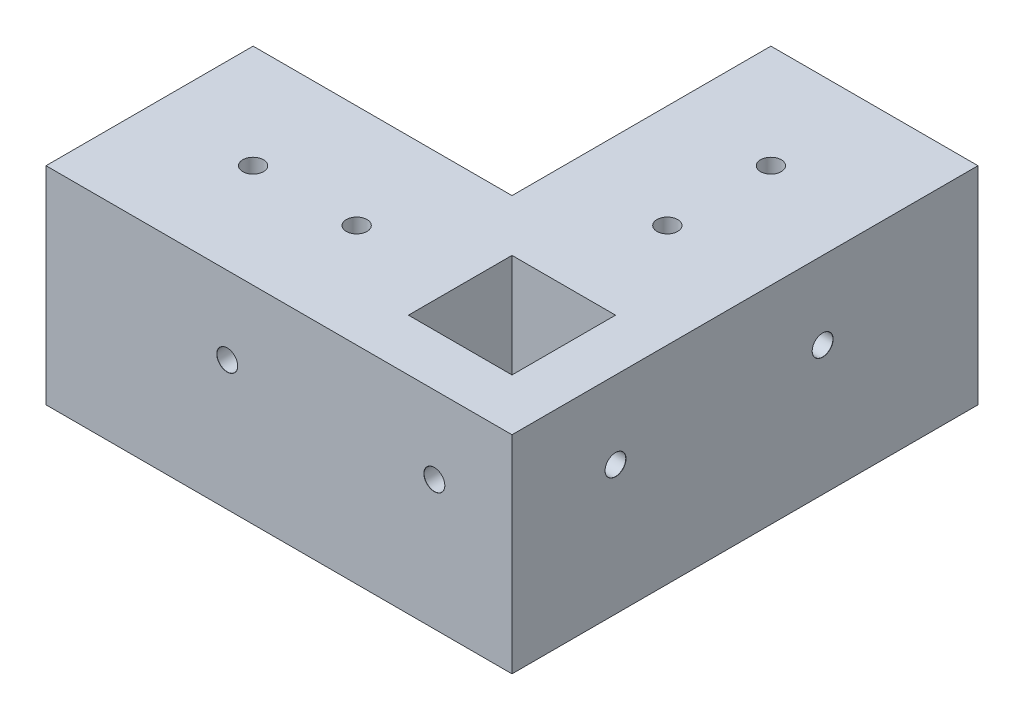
ISO-10303-21;
HEADER;
FILE_DESCRIPTION(('STEP AP214'),'2;1');
FILE_NAME('part.step','',(''),(''),'','','');
FILE_SCHEMA(('AUTOMOTIVE_DESIGN { 1 0 10303 214 1 1 1 1 }'));
ENDSEC;
DATA;
#1=APPLICATION_CONTEXT('core data for automotive mechanical design processes');
#2=APPLICATION_PROTOCOL_DEFINITION('international standard','automotive_design',2000,#1);
#3=PRODUCT_CONTEXT('',#1,'mechanical');
#4=PRODUCT('Part','Part','',(#3));
#5=PRODUCT_RELATED_PRODUCT_CATEGORY('part','',(#4));
#6=PRODUCT_DEFINITION_FORMATION('','',#4);
#7=PRODUCT_DEFINITION_CONTEXT('part definition',#1,'design');
#8=PRODUCT_DEFINITION('design','',#6,#7);
#9=PRODUCT_DEFINITION_SHAPE('','',#8);
#10=(LENGTH_UNIT() NAMED_UNIT(*) SI_UNIT(.MILLI.,.METRE.));
#11=(NAMED_UNIT(*) PLANE_ANGLE_UNIT() SI_UNIT($,.RADIAN.));
#12=(NAMED_UNIT(*) SI_UNIT($,.STERADIAN.) SOLID_ANGLE_UNIT());
#13=UNCERTAINTY_MEASURE_WITH_UNIT(LENGTH_MEASURE(1.E-05),#10,'distance_accuracy_value','');
#14=(GEOMETRIC_REPRESENTATION_CONTEXT(3) GLOBAL_UNCERTAINTY_ASSIGNED_CONTEXT((#13)) GLOBAL_UNIT_ASSIGNED_CONTEXT((#10,
#11,#12)) REPRESENTATION_CONTEXT('',''));
#15=CARTESIAN_POINT('',(0.,0.,0.));
#16=DIRECTION('',(0.,0.,1.));
#17=DIRECTION('',(1.,0.,0.));
#18=AXIS2_PLACEMENT_3D('',#15,#16,#17);
#19=CARTESIAN_POINT('',(0.,40.,-50.));
#20=DIRECTION('',(1.,0.,0.));
#21=DIRECTION('',(0.,0.,-1.));
#22=AXIS2_PLACEMENT_3D('',#19,#20,#21);
#23=PLANE('',#22);
#24=DIRECTION('',(0.,-1.,0.));
#25=VECTOR('',#24,1.);
#26=CARTESIAN_POINT('',(0.,40.,-50.));
#27=LINE('',#26,#25);
#28=CARTESIAN_POINT('',(0.,40.,-50.));
#29=VERTEX_POINT('',#28);
#30=CARTESIAN_POINT('',(0.,5.,-50.));
#31=VERTEX_POINT('',#30);
#32=EDGE_CURVE('E228',#29,#31,#27,.T.);
#33=ORIENTED_EDGE('',*,*,#32,.T.);
#34=DIRECTION('',(0.,0.,1.));
#35=VECTOR('',#34,1.);
#36=CARTESIAN_POINT('',(0.,5.,0.));
#37=LINE('',#36,#35);
#38=CARTESIAN_POINT('',(0.,5.,0.));
#39=VERTEX_POINT('',#38);
#40=EDGE_CURVE('E46',#31,#39,#37,.T.);
#41=ORIENTED_EDGE('',*,*,#40,.T.);
#42=DIRECTION('',(0.,-1.,0.));
#43=VECTOR('',#42,1.);
#44=CARTESIAN_POINT('',(0.,40.,0.));
#45=LINE('',#44,#43);
#46=CARTESIAN_POINT('',(0.,40.,0.));
#47=VERTEX_POINT('',#46);
#48=EDGE_CURVE('E248',#47,#39,#45,.T.);
#49=ORIENTED_EDGE('',*,*,#48,.F.);
#50=DIRECTION('',(0.,0.,1.));
#51=VECTOR('',#50,1.);
#52=CARTESIAN_POINT('',(0.,40.,-50.));
#53=LINE('',#52,#51);
#54=EDGE_CURVE('E214',#29,#47,#53,.T.);
#55=ORIENTED_EDGE('',*,*,#54,.F.);
#56=EDGE_LOOP('',(#33,#41,#49,#55));
#57=FACE_BOUND('',#56,.T.);
#58=ADVANCED_FACE('F37',(#57),#23,.F.);
#59=CARTESIAN_POINT('',(0.,40.,0.));
#60=DIRECTION('',(0.,0.,1.));
#61=DIRECTION('',(1.,0.,0.));
#62=AXIS2_PLACEMENT_3D('',#59,#60,#61);
#63=PLANE('',#62);
#64=ORIENTED_EDGE('',*,*,#48,.T.);
#65=DIRECTION('',(-1.,0.,0.));
#66=VECTOR('',#65,1.);
#67=CARTESIAN_POINT('',(-50.,5.,0.));
#68=LINE('',#67,#66);
#69=CARTESIAN_POINT('',(-50.,5.,0.));
#70=VERTEX_POINT('',#69);
#71=EDGE_CURVE('E251',#39,#70,#68,.T.);
#72=ORIENTED_EDGE('',*,*,#71,.T.);
#73=DIRECTION('',(0.,-1.,0.));
#74=VECTOR('',#73,1.);
#75=CARTESIAN_POINT('',(-50.,40.,0.));
#76=LINE('',#75,#74);
#77=CARTESIAN_POINT('',(-50.,40.,0.));
#78=VERTEX_POINT('',#77);
#79=EDGE_CURVE('E245',#78,#70,#76,.T.);
#80=ORIENTED_EDGE('',*,*,#79,.F.);
#81=DIRECTION('',(-1.,0.,0.));
#82=VECTOR('',#81,1.);
#83=CARTESIAN_POINT('',(0.,40.,0.));
#84=LINE('',#83,#82);
#85=EDGE_CURVE('E217',#47,#78,#84,.T.);
#86=ORIENTED_EDGE('',*,*,#85,.F.);
#87=EDGE_LOOP('',(#64,#72,#80,#86));
#88=FACE_BOUND('',#87,.T.);
#89=ADVANCED_FACE('F266',(#88),#63,.F.);
#90=CARTESIAN_POINT('',(-50.,40.,0.));
#91=DIRECTION('',(1.,0.,0.));
#92=DIRECTION('',(0.,0.,-1.));
#93=AXIS2_PLACEMENT_3D('',#90,#91,#92);
#94=PLANE('',#93);
#95=ORIENTED_EDGE('',*,*,#79,.T.);
#96=CARTESIAN_POINT('',(-50.,5.,5.00000000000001));
#97=DIRECTION('',(1.,0.,0.));
#98=DIRECTION('',(0.,0.,-1.));
#99=AXIS2_PLACEMENT_3D('',#96,#97,#98);
#100=CIRCLE('',#99,5.);
#101=CARTESIAN_POINT('',(-50.,0.,5.00000000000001));
#102=VERTEX_POINT('',#101);
#103=EDGE_CURVE('E254',#70,#102,#100,.F.);
#104=ORIENTED_EDGE('',*,*,#103,.T.);
#105=DIRECTION('',(0.,0.,1.));
#106=VECTOR('',#105,1.);
#107=CARTESIAN_POINT('',(-50.,0.,0.));
#108=LINE('',#107,#106);
#109=CARTESIAN_POINT('',(-50.,0.,40.));
#110=VERTEX_POINT('',#109);
#111=EDGE_CURVE('E213',#102,#110,#108,.T.);
#112=ORIENTED_EDGE('',*,*,#111,.T.);
#113=DIRECTION('',(0.,-1.,0.));
#114=VECTOR('',#113,1.);
#115=CARTESIAN_POINT('',(-50.,40.,40.));
#116=LINE('',#115,#114);
#117=CARTESIAN_POINT('',(-50.,40.,40.));
#118=VERTEX_POINT('',#117);
#119=EDGE_CURVE('E242',#118,#110,#116,.T.);
#120=ORIENTED_EDGE('',*,*,#119,.F.);
#121=DIRECTION('',(0.,0.,1.));
#122=VECTOR('',#121,1.);
#123=CARTESIAN_POINT('',(-50.,40.,0.));
#124=LINE('',#123,#122);
#125=EDGE_CURVE('E220',#78,#118,#124,.T.);
#126=ORIENTED_EDGE('',*,*,#125,.F.);
#127=EDGE_LOOP('',(#95,#104,#112,#120,#126));
#128=FACE_BOUND('',#127,.T.);
#129=ADVANCED_FACE('F274',(#128),#94,.F.);
#130=CARTESIAN_POINT('',(-50.,40.,40.));
#131=DIRECTION('',(0.,0.,-1.));
#132=DIRECTION('',(-1.,0.,0.));
#133=AXIS2_PLACEMENT_3D('',#130,#131,#132);
#134=PLANE('',#133);
#135=CARTESIAN_POINT('',(25.,25.,40.));
#136=DIRECTION('',(0.,0.,1.));
#137=DIRECTION('',(1.,0.,0.));
#138=AXIS2_PLACEMENT_3D('',#135,#136,#137);
#139=CIRCLE('',#138,2.025);
#140=CARTESIAN_POINT('',(27.025,25.,40.));
#141=VERTEX_POINT('',#140);
#142=EDGE_CURVE('E183',#141,#141,#139,.T.);
#143=ORIENTED_EDGE('',*,*,#142,.F.);
#144=EDGE_LOOP('',(#143));
#145=FACE_BOUND('',#144,.T.);
#146=CARTESIAN_POINT('',(-15.,25.,40.));
#147=DIRECTION('',(0.,0.,1.));
#148=DIRECTION('',(1.,0.,0.));
#149=AXIS2_PLACEMENT_3D('',#146,#147,#148);
#150=CIRCLE('',#149,2.025);
#151=CARTESIAN_POINT('',(-12.975,25.,40.));
#152=VERTEX_POINT('',#151);
#153=EDGE_CURVE('E189',#152,#152,#150,.T.);
#154=ORIENTED_EDGE('',*,*,#153,.F.);
#155=EDGE_LOOP('',(#154));
#156=FACE_BOUND('',#155,.T.);
#157=DIRECTION('',(1.,0.,0.));
#158=VECTOR('',#157,1.);
#159=CARTESIAN_POINT('',(-50.,0.,40.));
#160=LINE('',#159,#158);
#161=CARTESIAN_POINT('',(40.,0.,40.));
#162=VERTEX_POINT('',#161);
#163=EDGE_CURVE('E230',#110,#162,#160,.T.);
#164=ORIENTED_EDGE('',*,*,#163,.T.);
#165=DIRECTION('',(0.,-1.,0.));
#166=VECTOR('',#165,1.);
#167=CARTESIAN_POINT('',(40.,40.,40.));
#168=LINE('',#167,#166);
#169=CARTESIAN_POINT('',(40.,40.,40.));
#170=VERTEX_POINT('',#169);
#171=EDGE_CURVE('E239',#170,#162,#168,.T.);
#172=ORIENTED_EDGE('',*,*,#171,.F.);
#173=DIRECTION('',(1.,0.,0.));
#174=VECTOR('',#173,1.);
#175=CARTESIAN_POINT('',(-50.,40.,40.));
#176=LINE('',#175,#174);
#177=EDGE_CURVE('E222',#118,#170,#176,.T.);
#178=ORIENTED_EDGE('',*,*,#177,.F.);
#179=ORIENTED_EDGE('',*,*,#119,.T.);
#180=EDGE_LOOP('',(#164,#172,#178,#179));
#181=FACE_BOUND('',#180,.T.);
#182=ADVANCED_FACE('F283',(#145,#156,#181),#134,.F.);
#183=CARTESIAN_POINT('',(40.,40.,40.));
#184=DIRECTION('',(-1.,0.,0.));
#185=DIRECTION('',(0.,0.,1.));
#186=AXIS2_PLACEMENT_3D('',#183,#184,#185);
#187=PLANE('',#186);
#188=CARTESIAN_POINT('',(40.,25.,20.));
#189=DIRECTION('',(1.,0.,0.));
#190=DIRECTION('',(0.,0.,-1.));
#191=AXIS2_PLACEMENT_3D('',#188,#189,#190);
#192=CIRCLE('',#191,2.025);
#193=CARTESIAN_POINT('',(40.,25.,17.975));
#194=VERTEX_POINT('',#193);
#195=EDGE_CURVE('E198',#194,#194,#192,.T.);
#196=ORIENTED_EDGE('',*,*,#195,.F.);
#197=EDGE_LOOP('',(#196));
#198=FACE_BOUND('',#197,.T.);
#199=CARTESIAN_POINT('',(40.,25.,-20.));
#200=DIRECTION('',(1.,0.,0.));
#201=DIRECTION('',(0.,0.,-1.));
#202=AXIS2_PLACEMENT_3D('',#199,#200,#201);
#203=CIRCLE('',#202,2.025);
#204=CARTESIAN_POINT('',(40.,25.,-22.025));
#205=VERTEX_POINT('',#204);
#206=EDGE_CURVE('E204',#205,#205,#203,.T.);
#207=ORIENTED_EDGE('',*,*,#206,.F.);
#208=EDGE_LOOP('',(#207));
#209=FACE_BOUND('',#208,.T.);
#210=DIRECTION('',(0.,0.,-1.));
#211=VECTOR('',#210,1.);
#212=CARTESIAN_POINT('',(40.,0.,40.));
#213=LINE('',#212,#211);
#214=CARTESIAN_POINT('',(40.,0.,-50.));
#215=VERTEX_POINT('',#214);
#216=EDGE_CURVE('E232',#162,#215,#213,.T.);
#217=ORIENTED_EDGE('',*,*,#216,.T.);
#218=DIRECTION('',(0.,-1.,0.));
#219=VECTOR('',#218,1.);
#220=CARTESIAN_POINT('',(40.,40.,-50.));
#221=LINE('',#220,#219);
#222=CARTESIAN_POINT('',(40.,40.,-50.));
#223=VERTEX_POINT('',#222);
#224=EDGE_CURVE('E236',#223,#215,#221,.T.);
#225=ORIENTED_EDGE('',*,*,#224,.F.);
#226=DIRECTION('',(0.,0.,-1.));
#227=VECTOR('',#226,1.);
#228=CARTESIAN_POINT('',(40.,40.,40.));
#229=LINE('',#228,#227);
#230=EDGE_CURVE('E224',#170,#223,#229,.T.);
#231=ORIENTED_EDGE('',*,*,#230,.F.);
#232=ORIENTED_EDGE('',*,*,#171,.T.);
#233=EDGE_LOOP('',(#217,#225,#231,#232));
#234=FACE_BOUND('',#233,.T.);
#235=ADVANCED_FACE('F287',(#198,#209,#234),#187,.F.);
#236=CARTESIAN_POINT('',(40.,40.,-50.));
#237=DIRECTION('',(0.,0.,1.));
#238=DIRECTION('',(1.,0.,0.));
#239=AXIS2_PLACEMENT_3D('',#236,#237,#238);
#240=PLANE('',#239);
#241=DIRECTION('',(-1.,0.,0.));
#242=VECTOR('',#241,1.);
#243=CARTESIAN_POINT('',(40.,0.,-50.));
#244=LINE('',#243,#242);
#245=CARTESIAN_POINT('',(5.,0.,-50.));
#246=VERTEX_POINT('',#245);
#247=EDGE_CURVE('E218',#215,#246,#244,.T.);
#248=ORIENTED_EDGE('',*,*,#247,.T.);
#249=CARTESIAN_POINT('',(5.,5.,-50.));
#250=DIRECTION('',(0.,0.,1.));
#251=DIRECTION('',(1.,0.,0.));
#252=AXIS2_PLACEMENT_3D('',#249,#250,#251);
#253=CIRCLE('',#252,5.);
#254=EDGE_CURVE('E11',#246,#31,#253,.F.);
#255=ORIENTED_EDGE('',*,*,#254,.T.);
#256=ORIENTED_EDGE('',*,*,#32,.F.);
#257=DIRECTION('',(-1.,0.,0.));
#258=VECTOR('',#257,1.);
#259=CARTESIAN_POINT('',(40.,40.,-50.));
#260=LINE('',#259,#258);
#261=EDGE_CURVE('E226',#223,#29,#260,.T.);
#262=ORIENTED_EDGE('',*,*,#261,.F.);
#263=ORIENTED_EDGE('',*,*,#224,.T.);
#264=EDGE_LOOP('',(#248,#255,#256,#262,#263));
#265=FACE_BOUND('',#264,.T.);
#266=ADVANCED_FACE('F292',(#265),#240,.F.);
#267=CARTESIAN_POINT('',(0.,40.,0.));
#268=DIRECTION('',(0.,-1.,0.));
#269=DIRECTION('',(0.,0.,-1.));
#270=AXIS2_PLACEMENT_3D('',#267,#268,#269);
#271=PLANE('',#270);
#272=CARTESIAN_POINT('',(-30.,40.,20.));
#273=DIRECTION('',(0.,1.,0.));
#274=DIRECTION('',(0.,0.,1.));
#275=AXIS2_PLACEMENT_3D('',#272,#273,#274);
#276=CIRCLE('',#275,2.);
#277=CARTESIAN_POINT('',(-30.,40.,22.));
#278=VERTEX_POINT('',#277);
#279=EDGE_CURVE('E650',#278,#278,#276,.T.);
#280=ORIENTED_EDGE('',*,*,#279,.F.);
#281=EDGE_LOOP('',(#280));
#282=FACE_BOUND('',#281,.T.);
#283=CARTESIAN_POINT('',(20.,40.,-9.99999999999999));
#284=DIRECTION('',(0.,1.,0.));
#285=DIRECTION('',(0.,0.,1.));
#286=AXIS2_PLACEMENT_3D('',#283,#284,#285);
#287=CIRCLE('',#286,2.);
#288=CARTESIAN_POINT('',(20.,40.,-7.99999999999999));
#289=VERTEX_POINT('',#288);
#290=EDGE_CURVE('E656',#289,#289,#287,.T.);
#291=ORIENTED_EDGE('',*,*,#290,.F.);
#292=EDGE_LOOP('',(#291));
#293=FACE_BOUND('',#292,.T.);
#294=CARTESIAN_POINT('',(20.,40.,-30.));
#295=DIRECTION('',(0.,1.,0.));
#296=DIRECTION('',(0.,0.,1.));
#297=AXIS2_PLACEMENT_3D('',#294,#295,#296);
#298=CIRCLE('',#297,2.);
#299=CARTESIAN_POINT('',(20.,40.,-28.));
#300=VERTEX_POINT('',#299);
#301=EDGE_CURVE('E666',#300,#300,#298,.T.);
#302=ORIENTED_EDGE('',*,*,#301,.F.);
#303=EDGE_LOOP('',(#302));
#304=FACE_BOUND('',#303,.T.);
#305=CARTESIAN_POINT('',(-9.99999999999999,40.,20.));
#306=DIRECTION('',(0.,1.,0.));
#307=DIRECTION('',(0.,0.,1.));
#308=AXIS2_PLACEMENT_3D('',#305,#306,#307);
#309=CIRCLE('',#308,2.);
#310=CARTESIAN_POINT('',(-9.99999999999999,40.,22.));
#311=VERTEX_POINT('',#310);
#312=EDGE_CURVE('E653',#311,#311,#309,.T.);
#313=ORIENTED_EDGE('',*,*,#312,.F.);
#314=EDGE_LOOP('',(#313));
#315=FACE_BOUND('',#314,.T.);
#316=DIRECTION('',(1.,0.,0.));
#317=VECTOR('',#316,1.);
#318=CARTESIAN_POINT('',(10.,40.,30.));
#319=LINE('',#318,#317);
#320=CARTESIAN_POINT('',(10.,40.,30.));
#321=VERTEX_POINT('',#320);
#322=CARTESIAN_POINT('',(30.,40.,30.));
#323=VERTEX_POINT('',#322);
#324=EDGE_CURVE('E168',#321,#323,#319,.T.);
#325=ORIENTED_EDGE('',*,*,#324,.F.);
#326=DIRECTION('',(0.,0.,1.));
#327=VECTOR('',#326,1.);
#328=CARTESIAN_POINT('',(10.,40.,10.));
#329=LINE('',#328,#327);
#330=CARTESIAN_POINT('',(10.,40.,10.));
#331=VERTEX_POINT('',#330);
#332=EDGE_CURVE('E138',#331,#321,#329,.T.);
#333=ORIENTED_EDGE('',*,*,#332,.F.);
#334=DIRECTION('',(-1.,0.,0.));
#335=VECTOR('',#334,1.);
#336=CARTESIAN_POINT('',(10.,40.,10.));
#337=LINE('',#336,#335);
#338=CARTESIAN_POINT('',(30.,40.,10.));
#339=VERTEX_POINT('',#338);
#340=EDGE_CURVE('E156',#339,#331,#337,.T.);
#341=ORIENTED_EDGE('',*,*,#340,.F.);
#342=DIRECTION('',(0.,0.,-1.));
#343=VECTOR('',#342,1.);
#344=CARTESIAN_POINT('',(30.,40.,10.));
#345=LINE('',#344,#343);
#346=EDGE_CURVE('E159',#323,#339,#345,.T.);
#347=ORIENTED_EDGE('',*,*,#346,.F.);
#348=EDGE_LOOP('',(#325,#333,#341,#347));
#349=FACE_BOUND('',#348,.T.);
#350=ORIENTED_EDGE('',*,*,#54,.T.);
#351=ORIENTED_EDGE('',*,*,#85,.T.);
#352=ORIENTED_EDGE('',*,*,#125,.T.);
#353=ORIENTED_EDGE('',*,*,#177,.T.);
#354=ORIENTED_EDGE('',*,*,#230,.T.);
#355=ORIENTED_EDGE('',*,*,#261,.T.);
#356=EDGE_LOOP('',(#350,#351,#352,#353,#354,#355));
#357=FACE_BOUND('',#356,.T.);
#358=ADVANCED_FACE('F291',(#282,#293,#304,#315,#349,#357),#271,.F.);
#359=CARTESIAN_POINT('',(0.,0.,0.));
#360=DIRECTION('',(0.,-1.,0.));
#361=DIRECTION('',(0.,0.,-1.));
#362=AXIS2_PLACEMENT_3D('',#359,#360,#361);
#363=PLANE('',#362);
#364=ORIENTED_EDGE('',*,*,#111,.F.);
#365=DIRECTION('',(-1.,0.,0.));
#366=VECTOR('',#365,1.);
#367=CARTESIAN_POINT('',(0.,0.,5.));
#368=LINE('',#367,#366);
#369=CARTESIAN_POINT('',(5.,0.,5.));
#370=VERTEX_POINT('',#369);
#371=EDGE_CURVE('E59',#102,#370,#368,.F.);
#372=ORIENTED_EDGE('',*,*,#371,.T.);
#373=DIRECTION('',(0.,0.,1.));
#374=VECTOR('',#373,1.);
#375=CARTESIAN_POINT('',(5.,0.,-50.));
#376=LINE('',#375,#374);
#377=EDGE_CURVE('E256',#370,#246,#376,.F.);
#378=ORIENTED_EDGE('',*,*,#377,.T.);
#379=ORIENTED_EDGE('',*,*,#247,.F.);
#380=ORIENTED_EDGE('',*,*,#216,.F.);
#381=ORIENTED_EDGE('',*,*,#163,.F.);
#382=EDGE_LOOP('',(#364,#372,#378,#379,#380,#381));
#383=FACE_BOUND('',#382,.T.);
#384=ADVANCED_FACE('F278',(#383),#363,.T.);
#385=CARTESIAN_POINT('',(30.,25.,-20.));
#386=DIRECTION('',(1.,0.,0.));
#387=DIRECTION('',(0.,0.,-1.));
#388=AXIS2_PLACEMENT_3D('',#385,#386,#387);
#389=CONICAL_SURFACE('',#388,2.,1.02974425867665);
#390=CARTESIAN_POINT('',(28.7982787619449,25.,-20.));
#391=VERTEX_POINT('',#390);
#392=VERTEX_LOOP('',#391);
#393=FACE_BOUND('',#392,.T.);
#394=CARTESIAN_POINT('',(30.,25.,-20.));
#395=DIRECTION('',(1.,0.,0.));
#396=DIRECTION('',(0.,0.,-1.));
#397=AXIS2_PLACEMENT_3D('',#394,#395,#396);
#398=CIRCLE('',#397,2.);
#399=CARTESIAN_POINT('',(30.,25.,-22.));
#400=VERTEX_POINT('',#399);
#401=EDGE_CURVE('E210',#400,#400,#398,.T.);
#402=ORIENTED_EDGE('',*,*,#401,.T.);
#403=EDGE_LOOP('',(#402));
#404=FACE_BOUND('',#403,.T.);
#405=ADVANCED_FACE('F377',(#393,#404),#389,.F.);
#406=CARTESIAN_POINT('',(40.,25.,-20.));
#407=DIRECTION('',(1.,0.,0.));
#408=DIRECTION('',(0.,0.,-1.));
#409=AXIS2_PLACEMENT_3D('',#406,#407,#408);
#410=CYLINDRICAL_SURFACE('',#409,2.);
#411=ORIENTED_EDGE('',*,*,#401,.F.);
#412=EDGE_LOOP('',(#411));
#413=FACE_BOUND('',#412,.T.);
#414=CARTESIAN_POINT('',(39.975,25.,-20.));
#415=DIRECTION('',(1.,0.,0.));
#416=DIRECTION('',(0.,0.,-1.));
#417=AXIS2_PLACEMENT_3D('',#414,#415,#416);
#418=CIRCLE('',#417,2.);
#419=CARTESIAN_POINT('',(39.975,25.,-22.));
#420=VERTEX_POINT('',#419);
#421=EDGE_CURVE('E207',#420,#420,#418,.T.);
#422=ORIENTED_EDGE('',*,*,#421,.T.);
#423=EDGE_LOOP('',(#422));
#424=FACE_BOUND('',#423,.T.);
#425=ADVANCED_FACE('F373',(#413,#424),#410,.F.);
#426=CARTESIAN_POINT('',(40.,25.,-20.));
#427=DIRECTION('',(1.,0.,0.));
#428=DIRECTION('',(0.,0.,-1.));
#429=AXIS2_PLACEMENT_3D('',#426,#427,#428);
#430=CONICAL_SURFACE('',#429,2.025,0.785398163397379);
#431=ORIENTED_EDGE('',*,*,#421,.F.);
#432=EDGE_LOOP('',(#431));
#433=FACE_BOUND('',#432,.T.);
#434=ORIENTED_EDGE('',*,*,#206,.T.);
#435=EDGE_LOOP('',(#434));
#436=FACE_BOUND('',#435,.T.);
#437=ADVANCED_FACE('F369',(#433,#436),#430,.F.);
#438=CARTESIAN_POINT('',(40.,25.,20.));
#439=DIRECTION('',(1.,0.,0.));
#440=DIRECTION('',(0.,0.,-1.));
#441=AXIS2_PLACEMENT_3D('',#438,#439,#440);
#442=CYLINDRICAL_SURFACE('',#441,2.);
#443=CARTESIAN_POINT('',(30.,25.,20.));
#444=DIRECTION('',(1.,0.,0.));
#445=DIRECTION('',(0.,0.,-1.));
#446=AXIS2_PLACEMENT_3D('',#443,#444,#445);
#447=CIRCLE('',#446,2.);
#448=CARTESIAN_POINT('',(30.,25.,18.));
#449=VERTEX_POINT('',#448);
#450=EDGE_CURVE('E180',#449,#449,#447,.F.);
#451=ORIENTED_EDGE('',*,*,#450,.T.);
#452=EDGE_LOOP('',(#451));
#453=FACE_BOUND('',#452,.T.);
#454=CARTESIAN_POINT('',(39.975,25.,20.));
#455=DIRECTION('',(1.,0.,0.));
#456=DIRECTION('',(0.,0.,-1.));
#457=AXIS2_PLACEMENT_3D('',#454,#455,#456);
#458=CIRCLE('',#457,2.);
#459=CARTESIAN_POINT('',(39.975,25.,18.));
#460=VERTEX_POINT('',#459);
#461=EDGE_CURVE('E201',#460,#460,#458,.T.);
#462=ORIENTED_EDGE('',*,*,#461,.T.);
#463=EDGE_LOOP('',(#462));
#464=FACE_BOUND('',#463,.T.);
#465=ADVANCED_FACE('F365',(#453,#464),#442,.F.);
#466=CARTESIAN_POINT('',(40.,25.,20.));
#467=DIRECTION('',(1.,0.,0.));
#468=DIRECTION('',(0.,0.,-1.));
#469=AXIS2_PLACEMENT_3D('',#466,#467,#468);
#470=CONICAL_SURFACE('',#469,2.025,0.78539816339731);
#471=ORIENTED_EDGE('',*,*,#461,.F.);
#472=EDGE_LOOP('',(#471));
#473=FACE_BOUND('',#472,.T.);
#474=ORIENTED_EDGE('',*,*,#195,.T.);
#475=EDGE_LOOP('',(#474));
#476=FACE_BOUND('',#475,.T.);
#477=ADVANCED_FACE('F361',(#473,#476),#470,.F.);
#478=CARTESIAN_POINT('',(-15.,25.,30.));
#479=DIRECTION('',(0.,0.,1.));
#480=DIRECTION('',(1.,0.,0.));
#481=AXIS2_PLACEMENT_3D('',#478,#479,#480);
#482=CONICAL_SURFACE('',#481,1.99999999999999,1.02974425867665);
#483=CARTESIAN_POINT('',(-15.,25.,28.7982787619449));
#484=VERTEX_POINT('',#483);
#485=VERTEX_LOOP('',#484);
#486=FACE_BOUND('',#485,.T.);
#487=CARTESIAN_POINT('',(-15.,25.,30.));
#488=DIRECTION('',(0.,0.,1.));
#489=DIRECTION('',(1.,0.,0.));
#490=AXIS2_PLACEMENT_3D('',#487,#488,#489);
#491=CIRCLE('',#490,1.99999999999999);
#492=CARTESIAN_POINT('',(-13.,25.,30.));
#493=VERTEX_POINT('',#492);
#494=EDGE_CURVE('E195',#493,#493,#491,.T.);
#495=ORIENTED_EDGE('',*,*,#494,.T.);
#496=EDGE_LOOP('',(#495));
#497=FACE_BOUND('',#496,.T.);
#498=ADVANCED_FACE('F357',(#486,#497),#482,.F.);
#499=CARTESIAN_POINT('',(-15.,25.,40.));
#500=DIRECTION('',(0.,0.,1.));
#501=DIRECTION('',(1.,0.,0.));
#502=AXIS2_PLACEMENT_3D('',#499,#500,#501);
#503=CYLINDRICAL_SURFACE('',#502,1.99999999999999);
#504=ORIENTED_EDGE('',*,*,#494,.F.);
#505=EDGE_LOOP('',(#504));
#506=FACE_BOUND('',#505,.T.);
#507=CARTESIAN_POINT('',(-15.,25.,39.975));
#508=DIRECTION('',(0.,0.,1.));
#509=DIRECTION('',(1.,0.,0.));
#510=AXIS2_PLACEMENT_3D('',#507,#508,#509);
#511=CIRCLE('',#510,1.99999999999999);
#512=CARTESIAN_POINT('',(-13.,25.,39.975));
#513=VERTEX_POINT('',#512);
#514=EDGE_CURVE('E192',#513,#513,#511,.T.);
#515=ORIENTED_EDGE('',*,*,#514,.T.);
#516=EDGE_LOOP('',(#515));
#517=FACE_BOUND('',#516,.T.);
#518=ADVANCED_FACE('F353',(#506,#517),#503,.F.);
#519=CARTESIAN_POINT('',(-15.,25.,40.));
#520=DIRECTION('',(0.,0.,1.));
#521=DIRECTION('',(1.,0.,0.));
#522=AXIS2_PLACEMENT_3D('',#519,#520,#521);
#523=CONICAL_SURFACE('',#522,2.025,0.785398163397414);
#524=ORIENTED_EDGE('',*,*,#514,.F.);
#525=EDGE_LOOP('',(#524));
#526=FACE_BOUND('',#525,.T.);
#527=ORIENTED_EDGE('',*,*,#153,.T.);
#528=EDGE_LOOP('',(#527));
#529=FACE_BOUND('',#528,.T.);
#530=ADVANCED_FACE('F349',(#526,#529),#523,.F.);
#531=CARTESIAN_POINT('',(25.,25.,40.));
#532=DIRECTION('',(0.,0.,1.));
#533=DIRECTION('',(1.,0.,0.));
#534=AXIS2_PLACEMENT_3D('',#531,#532,#533);
#535=CYLINDRICAL_SURFACE('',#534,1.99999999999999);
#536=CARTESIAN_POINT('',(25.,25.,30.));
#537=DIRECTION('',(0.,0.,1.));
#538=DIRECTION('',(1.,0.,0.));
#539=AXIS2_PLACEMENT_3D('',#536,#537,#538);
#540=CIRCLE('',#539,1.99999999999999);
#541=CARTESIAN_POINT('',(27.,25.,30.));
#542=VERTEX_POINT('',#541);
#543=EDGE_CURVE('E174',#542,#542,#540,.F.);
#544=ORIENTED_EDGE('',*,*,#543,.T.);
#545=EDGE_LOOP('',(#544));
#546=FACE_BOUND('',#545,.T.);
#547=CARTESIAN_POINT('',(25.,25.,39.975));
#548=DIRECTION('',(0.,0.,1.));
#549=DIRECTION('',(1.,0.,0.));
#550=AXIS2_PLACEMENT_3D('',#547,#548,#549);
#551=CIRCLE('',#550,1.99999999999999);
#552=CARTESIAN_POINT('',(27.,25.,39.975));
#553=VERTEX_POINT('',#552);
#554=EDGE_CURVE('E186',#553,#553,#551,.T.);
#555=ORIENTED_EDGE('',*,*,#554,.T.);
#556=EDGE_LOOP('',(#555));
#557=FACE_BOUND('',#556,.T.);
#558=ADVANCED_FACE('F345',(#546,#557),#535,.F.);
#559=CARTESIAN_POINT('',(25.,25.,40.));
#560=DIRECTION('',(0.,0.,1.));
#561=DIRECTION('',(1.,0.,0.));
#562=AXIS2_PLACEMENT_3D('',#559,#560,#561);
#563=CONICAL_SURFACE('',#562,2.025,0.785398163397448);
#564=ORIENTED_EDGE('',*,*,#554,.F.);
#565=EDGE_LOOP('',(#564));
#566=FACE_BOUND('',#565,.T.);
#567=ORIENTED_EDGE('',*,*,#142,.T.);
#568=EDGE_LOOP('',(#567));
#569=FACE_BOUND('',#568,.T.);
#570=ADVANCED_FACE('F337',(#566,#569),#563,.F.);
#571=CARTESIAN_POINT('',(30.,10.,10.));
#572=DIRECTION('',(1.,0.,0.));
#573=DIRECTION('',(0.,0.,-1.));
#574=AXIS2_PLACEMENT_3D('',#571,#572,#573);
#575=PLANE('',#574);
#576=ORIENTED_EDGE('',*,*,#346,.T.);
#577=DIRECTION('',(0.,1.,0.));
#578=VECTOR('',#577,1.);
#579=CARTESIAN_POINT('',(30.,10.,10.));
#580=LINE('',#579,#578);
#581=CARTESIAN_POINT('',(30.,10.,10.));
#582=VERTEX_POINT('',#581);
#583=EDGE_CURVE('E175',#582,#339,#580,.T.);
#584=ORIENTED_EDGE('',*,*,#583,.F.);
#585=DIRECTION('',(0.,0.,-1.));
#586=VECTOR('',#585,1.);
#587=CARTESIAN_POINT('',(30.,10.,10.));
#588=LINE('',#587,#586);
#589=CARTESIAN_POINT('',(30.,10.,30.));
#590=VERTEX_POINT('',#589);
#591=EDGE_CURVE('E152',#590,#582,#588,.T.);
#592=ORIENTED_EDGE('',*,*,#591,.F.);
#593=DIRECTION('',(0.,1.,0.));
#594=VECTOR('',#593,1.);
#595=CARTESIAN_POINT('',(30.,10.,30.));
#596=LINE('',#595,#594);
#597=EDGE_CURVE('E142',#590,#323,#596,.T.);
#598=ORIENTED_EDGE('',*,*,#597,.T.);
#599=EDGE_LOOP('',(#576,#584,#592,#598));
#600=FACE_BOUND('',#599,.T.);
#601=ORIENTED_EDGE('',*,*,#450,.F.);
#602=EDGE_LOOP('',(#601));
#603=FACE_BOUND('',#602,.T.);
#604=ADVANCED_FACE('F334',(#600,#603),#575,.F.);
#605=CARTESIAN_POINT('',(10.,10.,30.));
#606=DIRECTION('',(0.,0.,1.));
#607=DIRECTION('',(1.,0.,0.));
#608=AXIS2_PLACEMENT_3D('',#605,#606,#607);
#609=PLANE('',#608);
#610=ORIENTED_EDGE('',*,*,#324,.T.);
#611=ORIENTED_EDGE('',*,*,#597,.F.);
#612=DIRECTION('',(1.,0.,0.));
#613=VECTOR('',#612,1.);
#614=CARTESIAN_POINT('',(10.,10.,30.));
#615=LINE('',#614,#613);
#616=CARTESIAN_POINT('',(10.,10.,30.));
#617=VERTEX_POINT('',#616);
#618=EDGE_CURVE('E146',#617,#590,#615,.T.);
#619=ORIENTED_EDGE('',*,*,#618,.F.);
#620=DIRECTION('',(0.,1.,0.));
#621=VECTOR('',#620,1.);
#622=CARTESIAN_POINT('',(10.,10.,30.));
#623=LINE('',#622,#621);
#624=EDGE_CURVE('E131',#617,#321,#623,.T.);
#625=ORIENTED_EDGE('',*,*,#624,.T.);
#626=EDGE_LOOP('',(#610,#611,#619,#625));
#627=FACE_BOUND('',#626,.T.);
#628=ORIENTED_EDGE('',*,*,#543,.F.);
#629=EDGE_LOOP('',(#628));
#630=FACE_BOUND('',#629,.T.);
#631=ADVANCED_FACE('F147',(#627,#630),#609,.F.);
#632=CARTESIAN_POINT('',(10.,10.,10.));
#633=DIRECTION('',(-1.,0.,0.));
#634=DIRECTION('',(0.,0.,1.));
#635=AXIS2_PLACEMENT_3D('',#632,#633,#634);
#636=PLANE('',#635);
#637=ORIENTED_EDGE('',*,*,#332,.T.);
#638=ORIENTED_EDGE('',*,*,#624,.F.);
#639=DIRECTION('',(0.,0.,1.));
#640=VECTOR('',#639,1.);
#641=CARTESIAN_POINT('',(10.,10.,10.));
#642=LINE('',#641,#640);
#643=CARTESIAN_POINT('',(10.,10.,10.));
#644=VERTEX_POINT('',#643);
#645=EDGE_CURVE('E135',#644,#617,#642,.T.);
#646=ORIENTED_EDGE('',*,*,#645,.F.);
#647=DIRECTION('',(0.,1.,0.));
#648=VECTOR('',#647,1.);
#649=CARTESIAN_POINT('',(10.,10.,10.));
#650=LINE('',#649,#648);
#651=EDGE_CURVE('E172',#644,#331,#650,.T.);
#652=ORIENTED_EDGE('',*,*,#651,.T.);
#653=EDGE_LOOP('',(#637,#638,#646,#652));
#654=FACE_BOUND('',#653,.T.);
#655=ADVANCED_FACE('F133',(#654),#636,.F.);
#656=CARTESIAN_POINT('',(10.,10.,10.));
#657=DIRECTION('',(0.,0.,-1.));
#658=DIRECTION('',(-1.,0.,0.));
#659=AXIS2_PLACEMENT_3D('',#656,#657,#658);
#660=PLANE('',#659);
#661=ORIENTED_EDGE('',*,*,#340,.T.);
#662=ORIENTED_EDGE('',*,*,#651,.F.);
#663=DIRECTION('',(-1.,0.,0.));
#664=VECTOR('',#663,1.);
#665=CARTESIAN_POINT('',(10.,10.,10.));
#666=LINE('',#665,#664);
#667=EDGE_CURVE('E143',#582,#644,#666,.T.);
#668=ORIENTED_EDGE('',*,*,#667,.F.);
#669=ORIENTED_EDGE('',*,*,#583,.T.);
#670=EDGE_LOOP('',(#661,#662,#668,#669));
#671=FACE_BOUND('',#670,.T.);
#672=ADVANCED_FACE('F323',(#671),#660,.F.);
#673=CARTESIAN_POINT('',(0.,10.,0.));
#674=DIRECTION('',(0.,1.,0.));
#675=DIRECTION('',(0.,0.,1.));
#676=AXIS2_PLACEMENT_3D('',#673,#674,#675);
#677=PLANE('',#676);
#678=ORIENTED_EDGE('',*,*,#645,.T.);
#679=ORIENTED_EDGE('',*,*,#618,.T.);
#680=ORIENTED_EDGE('',*,*,#591,.T.);
#681=ORIENTED_EDGE('',*,*,#667,.T.);
#682=EDGE_LOOP('',(#678,#679,#680,#681));
#683=FACE_BOUND('',#682,.T.);
#684=ADVANCED_FACE('F154',(#683),#677,.T.);
#685=CARTESIAN_POINT('',(5.,5.,-50.));
#686=DIRECTION('',(0.,0.,-1.));
#687=DIRECTION('',(-1.,0.,0.));
#688=AXIS2_PLACEMENT_3D('',#685,#686,#687);
#689=CYLINDRICAL_SURFACE('',#688,5.);
#690=ORIENTED_EDGE('',*,*,#254,.F.);
#691=ORIENTED_EDGE('',*,*,#377,.F.);
#692=CARTESIAN_POINT('',(5.,5.,5.));
#693=DIRECTION('',(0.707106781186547,0.,-0.707106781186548));
#694=DIRECTION('',(0.707106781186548,0.,0.707106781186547));
#695=AXIS2_PLACEMENT_3D('',#692,#693,#694);
#696=ELLIPSE('',#695,7.07106781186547,5.);
#697=EDGE_CURVE('E41',#39,#370,#696,.F.);
#698=ORIENTED_EDGE('',*,*,#697,.F.);
#699=ORIENTED_EDGE('',*,*,#40,.F.);
#700=EDGE_LOOP('',(#690,#691,#698,#699));
#701=FACE_BOUND('',#700,.T.);
#702=ADVANCED_FACE('F39',(#701),#689,.T.);
#703=CARTESIAN_POINT('',(0.,5.,5.));
#704=DIRECTION('',(1.,0.,0.));
#705=DIRECTION('',(0.,0.,-1.));
#706=AXIS2_PLACEMENT_3D('',#703,#704,#705);
#707=CYLINDRICAL_SURFACE('',#706,5.);
#708=ORIENTED_EDGE('',*,*,#697,.T.);
#709=ORIENTED_EDGE('',*,*,#371,.F.);
#710=ORIENTED_EDGE('',*,*,#103,.F.);
#711=ORIENTED_EDGE('',*,*,#71,.F.);
#712=EDGE_LOOP('',(#708,#709,#710,#711));
#713=FACE_BOUND('',#712,.T.);
#714=ADVANCED_FACE('F272',(#713),#707,.T.);
#715=CARTESIAN_POINT('',(-9.99999999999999,25.,20.));
#716=DIRECTION('',(0.,1.,0.));
#717=DIRECTION('',(0.,0.,1.));
#718=AXIS2_PLACEMENT_3D('',#715,#716,#717);
#719=CYLINDRICAL_SURFACE('',#718,2.);
#720=CARTESIAN_POINT('',(-9.99999999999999,25.,20.));
#721=DIRECTION('',(0.,1.,0.));
#722=DIRECTION('',(0.,0.,1.));
#723=AXIS2_PLACEMENT_3D('',#720,#721,#722);
#724=CIRCLE('',#723,2.);
#725=CARTESIAN_POINT('',(-9.99999999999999,25.,22.));
#726=VERTEX_POINT('',#725);
#727=EDGE_CURVE('E664',#726,#726,#724,.T.);
#728=ORIENTED_EDGE('',*,*,#727,.F.);
#729=EDGE_LOOP('',(#728));
#730=FACE_BOUND('',#729,.T.);
#731=ORIENTED_EDGE('',*,*,#312,.T.);
#732=EDGE_LOOP('',(#731));
#733=FACE_BOUND('',#732,.T.);
#734=ADVANCED_FACE('F312',(#730,#733),#719,.F.);
#735=CARTESIAN_POINT('',(-9.99999999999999,25.,20.));
#736=DIRECTION('',(0.,1.,0.));
#737=DIRECTION('',(0.,0.,1.));
#738=AXIS2_PLACEMENT_3D('',#735,#736,#737);
#739=PLANE('',#738);
#740=ORIENTED_EDGE('',*,*,#727,.T.);
#741=EDGE_LOOP('',(#740));
#742=FACE_BOUND('',#741,.T.);
#743=ADVANCED_FACE('F317',(#742),#739,.T.);
#744=CARTESIAN_POINT('',(20.,25.,-30.));
#745=DIRECTION('',(0.,1.,0.));
#746=DIRECTION('',(0.,0.,1.));
#747=AXIS2_PLACEMENT_3D('',#744,#745,#746);
#748=CYLINDRICAL_SURFACE('',#747,2.);
#749=CARTESIAN_POINT('',(20.,25.,-30.));
#750=DIRECTION('',(0.,1.,0.));
#751=DIRECTION('',(0.,0.,1.));
#752=AXIS2_PLACEMENT_3D('',#749,#750,#751);
#753=CIRCLE('',#752,2.);
#754=CARTESIAN_POINT('',(20.,25.,-28.));
#755=VERTEX_POINT('',#754);
#756=EDGE_CURVE('E162',#755,#755,#753,.T.);
#757=ORIENTED_EDGE('',*,*,#756,.F.);
#758=EDGE_LOOP('',(#757));
#759=FACE_BOUND('',#758,.T.);
#760=ORIENTED_EDGE('',*,*,#301,.T.);
#761=EDGE_LOOP('',(#760));
#762=FACE_BOUND('',#761,.T.);
#763=ADVANCED_FACE('F571',(#759,#762),#748,.F.);
#764=CARTESIAN_POINT('',(20.,25.,-30.));
#765=DIRECTION('',(0.,1.,0.));
#766=DIRECTION('',(0.,0.,1.));
#767=AXIS2_PLACEMENT_3D('',#764,#765,#766);
#768=PLANE('',#767);
#769=ORIENTED_EDGE('',*,*,#756,.T.);
#770=EDGE_LOOP('',(#769));
#771=FACE_BOUND('',#770,.T.);
#772=ADVANCED_FACE('F331',(#771),#768,.T.);
#773=CARTESIAN_POINT('',(20.,25.,-9.99999999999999));
#774=DIRECTION('',(0.,1.,0.));
#775=DIRECTION('',(0.,0.,1.));
#776=AXIS2_PLACEMENT_3D('',#773,#774,#775);
#777=CYLINDRICAL_SURFACE('',#776,2.);
#778=CARTESIAN_POINT('',(20.,25.,-9.99999999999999));
#779=DIRECTION('',(0.,1.,0.));
#780=DIRECTION('',(0.,0.,1.));
#781=AXIS2_PLACEMENT_3D('',#778,#779,#780);
#782=CIRCLE('',#781,2.);
#783=CARTESIAN_POINT('',(20.,25.,-7.99999999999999));
#784=VERTEX_POINT('',#783);
#785=EDGE_CURVE('E659',#784,#784,#782,.T.);
#786=ORIENTED_EDGE('',*,*,#785,.F.);
#787=EDGE_LOOP('',(#786));
#788=FACE_BOUND('',#787,.T.);
#789=ORIENTED_EDGE('',*,*,#290,.T.);
#790=EDGE_LOOP('',(#789));
#791=FACE_BOUND('',#790,.T.);
#792=ADVANCED_FACE('F589',(#788,#791),#777,.F.);
#793=CARTESIAN_POINT('',(20.,25.,-9.99999999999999));
#794=DIRECTION('',(0.,1.,0.));
#795=DIRECTION('',(0.,0.,1.));
#796=AXIS2_PLACEMENT_3D('',#793,#794,#795);
#797=PLANE('',#796);
#798=ORIENTED_EDGE('',*,*,#785,.T.);
#799=EDGE_LOOP('',(#798));
#800=FACE_BOUND('',#799,.T.);
#801=ADVANCED_FACE('F598',(#800),#797,.T.);
#802=CARTESIAN_POINT('',(-30.,25.,20.));
#803=DIRECTION('',(0.,1.,0.));
#804=DIRECTION('',(0.,0.,1.));
#805=AXIS2_PLACEMENT_3D('',#802,#803,#804);
#806=CYLINDRICAL_SURFACE('',#805,2.);
#807=CARTESIAN_POINT('',(-30.,25.,20.));
#808=DIRECTION('',(0.,1.,0.));
#809=DIRECTION('',(0.,0.,1.));
#810=AXIS2_PLACEMENT_3D('',#807,#808,#809);
#811=CIRCLE('',#810,2.);
#812=CARTESIAN_POINT('',(-30.,25.,22.));
#813=VERTEX_POINT('',#812);
#814=EDGE_CURVE('E271',#813,#813,#811,.T.);
#815=ORIENTED_EDGE('',*,*,#814,.F.);
#816=EDGE_LOOP('',(#815));
#817=FACE_BOUND('',#816,.T.);
#818=ORIENTED_EDGE('',*,*,#279,.T.);
#819=EDGE_LOOP('',(#818));
#820=FACE_BOUND('',#819,.T.);
#821=ADVANCED_FACE('F608',(#817,#820),#806,.F.);
#822=CARTESIAN_POINT('',(-30.,25.,20.));
#823=DIRECTION('',(0.,1.,0.));
#824=DIRECTION('',(0.,0.,1.));
#825=AXIS2_PLACEMENT_3D('',#822,#823,#824);
#826=PLANE('',#825);
#827=ORIENTED_EDGE('',*,*,#814,.T.);
#828=EDGE_LOOP('',(#827));
#829=FACE_BOUND('',#828,.T.);
#830=ADVANCED_FACE('F618',(#829),#826,.T.);
#831=CLOSED_SHELL('',(#58,#89,#129,#182,#235,#266,#358,#384,#405,#425,#437,#465,#477,#498,#518,
#530,#558,#570,#604,#631,#655,#672,#684,#702,#714,#734,#743,#763,#772,#792,#801,#821,#830));
#832=MANIFOLD_SOLID_BREP('B2',#831);
#833=ADVANCED_BREP_SHAPE_REPRESENTATION('',(#18,#832),#14);
#834=SHAPE_DEFINITION_REPRESENTATION(#9,#833);
ENDSEC;
END-ISO-10303-21;
